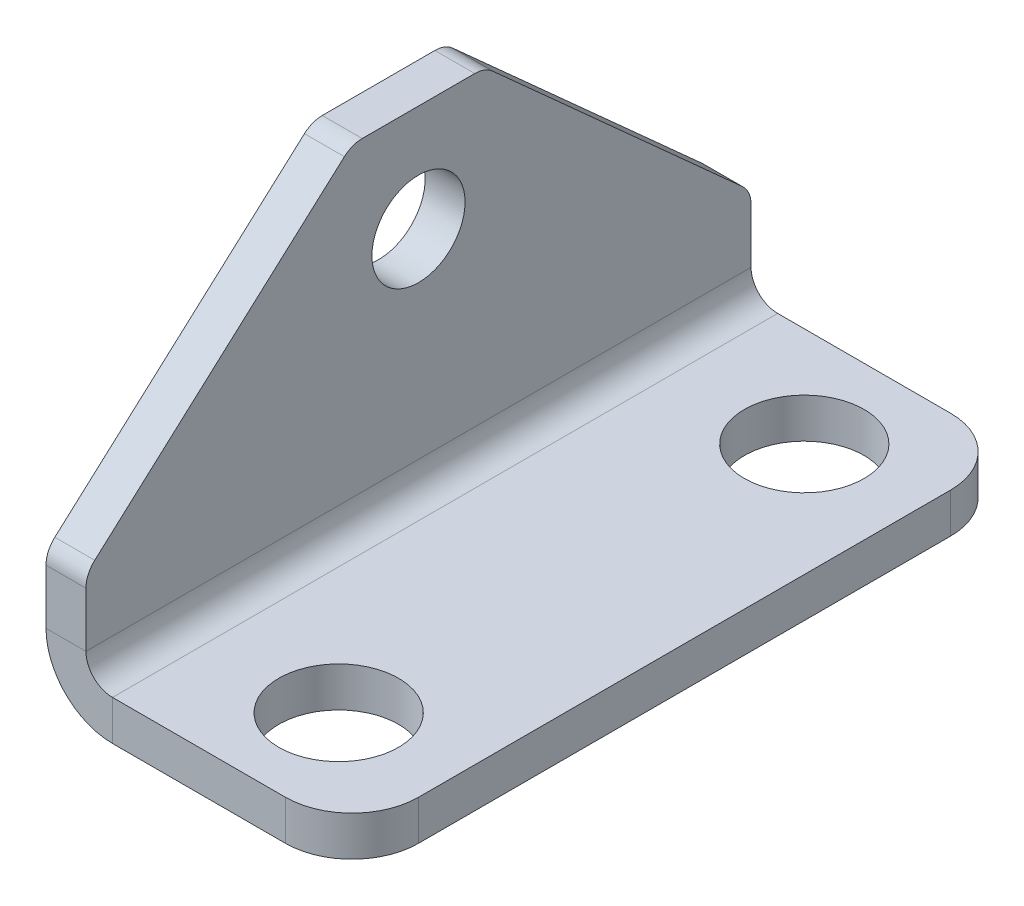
ISO-10303-21;
HEADER;
FILE_DESCRIPTION(('STEP AP214'),'2;1');
FILE_NAME('part.step','',(''),(''),'','','');
FILE_SCHEMA(('AUTOMOTIVE_DESIGN { 1 0 10303 214 1 1 1 1 }'));
ENDSEC;
DATA;
#1=APPLICATION_CONTEXT('core data for automotive mechanical design processes');
#2=APPLICATION_PROTOCOL_DEFINITION('international standard','automotive_design',2000,#1);
#3=PRODUCT_CONTEXT('',#1,'mechanical');
#4=PRODUCT('Part','Part','',(#3));
#5=PRODUCT_RELATED_PRODUCT_CATEGORY('part','',(#4));
#6=PRODUCT_DEFINITION_FORMATION('','',#4);
#7=PRODUCT_DEFINITION_CONTEXT('part definition',#1,'design');
#8=PRODUCT_DEFINITION('design','',#6,#7);
#9=PRODUCT_DEFINITION_SHAPE('','',#8);
#10=(LENGTH_UNIT() NAMED_UNIT(*) SI_UNIT(.MILLI.,.METRE.));
#11=(NAMED_UNIT(*) PLANE_ANGLE_UNIT() SI_UNIT($,.RADIAN.));
#12=(NAMED_UNIT(*) SI_UNIT($,.STERADIAN.) SOLID_ANGLE_UNIT());
#13=UNCERTAINTY_MEASURE_WITH_UNIT(LENGTH_MEASURE(1.E-05),#10,'distance_accuracy_value','');
#14=(GEOMETRIC_REPRESENTATION_CONTEXT(3) GLOBAL_UNCERTAINTY_ASSIGNED_CONTEXT((#13)) GLOBAL_UNIT_ASSIGNED_CONTEXT((#10,
#11,#12)) REPRESENTATION_CONTEXT('',''));
#15=CARTESIAN_POINT('',(0.,0.,0.));
#16=DIRECTION('',(0.,0.,1.));
#17=DIRECTION('',(1.,0.,0.));
#18=AXIS2_PLACEMENT_3D('',#15,#16,#17);
#19=CARTESIAN_POINT('',(0.,0.,50.));
#20=DIRECTION('',(1.,0.,0.));
#21=DIRECTION('',(0.,0.,-1.));
#22=AXIS2_PLACEMENT_3D('',#19,#20,#21);
#23=PLANE('',#22);
#24=CARTESIAN_POINT('',(0.,17.,25.));
#25=DIRECTION('',(1.,0.,0.));
#26=DIRECTION('',(0.,0.,-1.));
#27=AXIS2_PLACEMENT_3D('',#24,#25,#26);
#28=CIRCLE('',#27,3.49999999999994);
#29=CARTESIAN_POINT('',(0.,17.,21.5000000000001));
#30=VERTEX_POINT('',#29);
#31=EDGE_CURVE('E318',#30,#30,#28,.T.);
#32=ORIENTED_EDGE('',*,*,#31,.F.);
#33=EDGE_LOOP('',(#32));
#34=FACE_BOUND('',#33,.T.);
#35=DIRECTION('',(0.,0.66896473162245,-0.743294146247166));
#36=VECTOR('',#35,1.);
#37=CARTESIAN_POINT('',(0.,3.86740331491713,53.4806629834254));
#38=LINE('',#37,#36);
#39=CARTESIAN_POINT('',(0.,7.59586348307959,49.3379294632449));
#40=VERTEX_POINT('',#39);
#41=CARTESIAN_POINT('',(0.,24.4865882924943,30.5704574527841));
#42=VERTEX_POINT('',#41);
#43=EDGE_CURVE('E327',#40,#42,#38,.T.);
#44=ORIENTED_EDGE('',*,*,#43,.F.);
#45=CARTESIAN_POINT('',(0.,6.10927519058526,48.));
#46=DIRECTION('',(1.,0.,0.));
#47=DIRECTION('',(0.,0.,-1.));
#48=AXIS2_PLACEMENT_3D('',#45,#46,#47);
#49=CIRCLE('',#48,2.);
#50=CARTESIAN_POINT('',(0.,6.10927519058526,50.));
#51=VERTEX_POINT('',#50);
#52=EDGE_CURVE('E263',#40,#51,#49,.T.);
#53=ORIENTED_EDGE('',*,*,#52,.T.);
#54=DIRECTION('',(0.,-1.,0.));
#55=VECTOR('',#54,1.);
#56=CARTESIAN_POINT('',(0.,0.,50.));
#57=LINE('',#56,#55);
#58=CARTESIAN_POINT('',(0.,2.,50.));
#59=VERTEX_POINT('',#58);
#60=EDGE_CURVE('E213',#51,#59,#57,.T.);
#61=ORIENTED_EDGE('',*,*,#60,.T.);
#62=DIRECTION('',(0.,0.,-1.));
#63=VECTOR('',#62,1.);
#64=CARTESIAN_POINT('',(0.,2.,50.));
#65=LINE('',#64,#63);
#66=CARTESIAN_POINT('',(0.,2.,0.));
#67=VERTEX_POINT('',#66);
#68=EDGE_CURVE('E190',#59,#67,#65,.T.);
#69=ORIENTED_EDGE('',*,*,#68,.T.);
#70=DIRECTION('',(0.,-1.,0.));
#71=VECTOR('',#70,1.);
#72=CARTESIAN_POINT('',(0.,0.,0.));
#73=LINE('',#72,#71);
#74=CARTESIAN_POINT('',(0.,6.10927519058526,0.));
#75=VERTEX_POINT('',#74);
#76=EDGE_CURVE('E199',#75,#67,#73,.T.);
#77=ORIENTED_EDGE('',*,*,#76,.F.);
#78=CARTESIAN_POINT('',(0.,6.10927519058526,2.));
#79=DIRECTION('',(1.,0.,0.));
#80=DIRECTION('',(0.,0.,-1.));
#81=AXIS2_PLACEMENT_3D('',#78,#79,#80);
#82=CIRCLE('',#81,2.);
#83=CARTESIAN_POINT('',(0.,7.59586348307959,0.662070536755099));
#84=VERTEX_POINT('',#83);
#85=EDGE_CURVE('E261',#75,#84,#82,.T.);
#86=ORIENTED_EDGE('',*,*,#85,.T.);
#87=DIRECTION('',(0.,-0.66896473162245,-0.743294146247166));
#88=VECTOR('',#87,1.);
#89=CARTESIAN_POINT('',(0.,28.7292817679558,24.1436464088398));
#90=LINE('',#89,#88);
#91=CARTESIAN_POINT('',(0.,24.4865882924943,19.4295425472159));
#92=VERTEX_POINT('',#91);
#93=EDGE_CURVE('E333',#92,#84,#90,.T.);
#94=ORIENTED_EDGE('',*,*,#93,.F.);
#95=CARTESIAN_POINT('',(0.,23.,20.7674720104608));
#96=DIRECTION('',(1.,0.,0.));
#97=DIRECTION('',(0.,0.,-1.));
#98=AXIS2_PLACEMENT_3D('',#95,#96,#97);
#99=CIRCLE('',#98,2.);
#100=CARTESIAN_POINT('',(0.,25.,20.7674720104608));
#101=VERTEX_POINT('',#100);
#102=EDGE_CURVE('E257',#92,#101,#99,.T.);
#103=ORIENTED_EDGE('',*,*,#102,.T.);
#104=DIRECTION('',(0.,0.,-1.));
#105=VECTOR('',#104,1.);
#106=CARTESIAN_POINT('',(0.,25.,50.));
#107=LINE('',#106,#105);
#108=CARTESIAN_POINT('',(0.,25.,29.2325279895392));
#109=VERTEX_POINT('',#108);
#110=EDGE_CURVE('E229',#109,#101,#107,.T.);
#111=ORIENTED_EDGE('',*,*,#110,.F.);
#112=CARTESIAN_POINT('',(0.,23.,29.2325279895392));
#113=DIRECTION('',(1.,0.,0.));
#114=DIRECTION('',(0.,0.,-1.));
#115=AXIS2_PLACEMENT_3D('',#112,#113,#114);
#116=CIRCLE('',#115,2.);
#117=EDGE_CURVE('E259',#109,#42,#116,.T.);
#118=ORIENTED_EDGE('',*,*,#117,.T.);
#119=EDGE_LOOP('',(#44,#53,#61,#69,#77,#86,#94,#103,#111,#118));
#120=FACE_BOUND('',#119,.T.);
#121=ADVANCED_FACE('F47',(#34,#120),#23,.T.);
#122=CARTESIAN_POINT('',(-3.,25.,50.));
#123=DIRECTION('',(0.,1.,0.));
#124=DIRECTION('',(0.,0.,1.));
#125=AXIS2_PLACEMENT_3D('',#122,#123,#124);
#126=PLANE('',#125);
#127=DIRECTION('',(0.,0.,-1.));
#128=VECTOR('',#127,1.);
#129=CARTESIAN_POINT('',(-3.,25.,50.));
#130=LINE('',#129,#128);
#131=CARTESIAN_POINT('',(-3.,25.,29.2325279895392));
#132=VERTEX_POINT('',#131);
#133=CARTESIAN_POINT('',(-3.,25.,20.7674720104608));
#134=VERTEX_POINT('',#133);
#135=EDGE_CURVE('E226',#132,#134,#130,.T.);
#136=ORIENTED_EDGE('',*,*,#135,.F.);
#137=DIRECTION('',(1.,0.,0.));
#138=VECTOR('',#137,1.);
#139=CARTESIAN_POINT('',(-3.,25.,29.2325279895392));
#140=LINE('',#139,#138);
#141=EDGE_CURVE('E275',#132,#109,#140,.T.);
#142=ORIENTED_EDGE('',*,*,#141,.T.);
#143=ORIENTED_EDGE('',*,*,#110,.T.);
#144=DIRECTION('',(1.,0.,0.));
#145=VECTOR('',#144,1.);
#146=CARTESIAN_POINT('',(-3.,25.,20.7674720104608));
#147=LINE('',#146,#145);
#148=EDGE_CURVE('E272',#101,#134,#147,.F.);
#149=ORIENTED_EDGE('',*,*,#148,.T.);
#150=EDGE_LOOP('',(#136,#142,#143,#149));
#151=FACE_BOUND('',#150,.T.);
#152=ADVANCED_FACE('F374',(#151),#126,.T.);
#153=CARTESIAN_POINT('',(-3.,0.,50.));
#154=DIRECTION('',(1.,0.,0.));
#155=DIRECTION('',(0.,0.,-1.));
#156=AXIS2_PLACEMENT_3D('',#153,#154,#155);
#157=PLANE('',#156);
#158=CARTESIAN_POINT('',(-3.,17.,25.));
#159=DIRECTION('',(-1.,0.,0.));
#160=DIRECTION('',(0.,0.,1.));
#161=AXIS2_PLACEMENT_3D('',#158,#159,#160);
#162=CIRCLE('',#161,3.49999999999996);
#163=CARTESIAN_POINT('',(-3.,17.,28.5));
#164=VERTEX_POINT('',#163);
#165=EDGE_CURVE('E321',#164,#164,#162,.T.);
#166=ORIENTED_EDGE('',*,*,#165,.F.);
#167=EDGE_LOOP('',(#166));
#168=FACE_BOUND('',#167,.T.);
#169=DIRECTION('',(0.,1.,0.));
#170=VECTOR('',#169,1.);
#171=CARTESIAN_POINT('',(-3.,0.,50.));
#172=LINE('',#171,#170);
#173=CARTESIAN_POINT('',(-3.,6.10927519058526,50.));
#174=VERTEX_POINT('',#173);
#175=CARTESIAN_POINT('',(-3.,2.,50.));
#176=VERTEX_POINT('',#175);
#177=EDGE_CURVE('E215',#174,#176,#172,.F.);
#178=ORIENTED_EDGE('',*,*,#177,.F.);
#179=CARTESIAN_POINT('',(-3.,6.10927519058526,48.));
#180=DIRECTION('',(1.,0.,0.));
#181=DIRECTION('',(0.,0.,-1.));
#182=AXIS2_PLACEMENT_3D('',#179,#180,#181);
#183=CIRCLE('',#182,2.);
#184=CARTESIAN_POINT('',(-3.,7.59586348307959,49.3379294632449));
#185=VERTEX_POINT('',#184);
#186=EDGE_CURVE('E250',#174,#185,#183,.F.);
#187=ORIENTED_EDGE('',*,*,#186,.T.);
#188=DIRECTION('',(0.,0.66896473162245,-0.743294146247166));
#189=VECTOR('',#188,1.);
#190=CARTESIAN_POINT('',(-3.,3.86740331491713,53.4806629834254));
#191=LINE('',#190,#189);
#192=CARTESIAN_POINT('',(-3.,24.4865882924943,30.5704574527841));
#193=VERTEX_POINT('',#192);
#194=EDGE_CURVE('E324',#185,#193,#191,.T.);
#195=ORIENTED_EDGE('',*,*,#194,.T.);
#196=CARTESIAN_POINT('',(-3.,23.,29.2325279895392));
#197=DIRECTION('',(1.,0.,0.));
#198=DIRECTION('',(0.,0.,-1.));
#199=AXIS2_PLACEMENT_3D('',#196,#197,#198);
#200=CIRCLE('',#199,2.);
#201=EDGE_CURVE('E246',#193,#132,#200,.F.);
#202=ORIENTED_EDGE('',*,*,#201,.T.);
#203=ORIENTED_EDGE('',*,*,#135,.T.);
#204=CARTESIAN_POINT('',(-3.,23.,20.7674720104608));
#205=DIRECTION('',(1.,0.,0.));
#206=DIRECTION('',(0.,0.,-1.));
#207=AXIS2_PLACEMENT_3D('',#204,#205,#206);
#208=CIRCLE('',#207,2.);
#209=CARTESIAN_POINT('',(-3.,24.4865882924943,19.4295425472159));
#210=VERTEX_POINT('',#209);
#211=EDGE_CURVE('E244',#134,#210,#208,.F.);
#212=ORIENTED_EDGE('',*,*,#211,.T.);
#213=DIRECTION('',(0.,-0.66896473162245,-0.743294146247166));
#214=VECTOR('',#213,1.);
#215=CARTESIAN_POINT('',(-3.,28.7292817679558,24.1436464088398));
#216=LINE('',#215,#214);
#217=CARTESIAN_POINT('',(-3.,7.59586348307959,0.662070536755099));
#218=VERTEX_POINT('',#217);
#219=EDGE_CURVE('E330',#210,#218,#216,.T.);
#220=ORIENTED_EDGE('',*,*,#219,.T.);
#221=CARTESIAN_POINT('',(-3.,6.10927519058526,2.));
#222=DIRECTION('',(1.,0.,0.));
#223=DIRECTION('',(0.,0.,-1.));
#224=AXIS2_PLACEMENT_3D('',#221,#222,#223);
#225=CIRCLE('',#224,2.);
#226=CARTESIAN_POINT('',(-3.,6.10927519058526,0.));
#227=VERTEX_POINT('',#226);
#228=EDGE_CURVE('E248',#218,#227,#225,.F.);
#229=ORIENTED_EDGE('',*,*,#228,.T.);
#230=DIRECTION('',(0.,1.,0.));
#231=VECTOR('',#230,1.);
#232=CARTESIAN_POINT('',(-3.,0.,0.));
#233=LINE('',#232,#231);
#234=CARTESIAN_POINT('',(-3.,2.,0.));
#235=VERTEX_POINT('',#234);
#236=EDGE_CURVE('E201',#227,#235,#233,.F.);
#237=ORIENTED_EDGE('',*,*,#236,.T.);
#238=DIRECTION('',(0.,0.,-1.));
#239=VECTOR('',#238,1.);
#240=CARTESIAN_POINT('',(-3.,2.,50.));
#241=LINE('',#240,#239);
#242=EDGE_CURVE('E223',#176,#235,#241,.T.);
#243=ORIENTED_EDGE('',*,*,#242,.F.);
#244=EDGE_LOOP('',(#178,#187,#195,#202,#203,#212,#220,#229,#237,#243));
#245=FACE_BOUND('',#244,.T.);
#246=ADVANCED_FACE('F350',(#168,#245),#157,.F.);
#247=CARTESIAN_POINT('',(2.,-3.,0.));
#248=DIRECTION('',(0.,0.,-1.));
#249=DIRECTION('',(-1.,0.,0.));
#250=AXIS2_PLACEMENT_3D('',#247,#248,#249);
#251=PLANE('',#250);
#252=ORIENTED_EDGE('',*,*,#236,.F.);
#253=DIRECTION('',(1.,0.,0.));
#254=VECTOR('',#253,1.);
#255=CARTESIAN_POINT('',(2.,6.10927519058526,0.));
#256=LINE('',#255,#254);
#257=EDGE_CURVE('E270',#227,#75,#256,.T.);
#258=ORIENTED_EDGE('',*,*,#257,.T.);
#259=ORIENTED_EDGE('',*,*,#76,.T.);
#260=DIRECTION('',(-1.,0.,0.));
#261=VECTOR('',#260,1.);
#262=CARTESIAN_POINT('',(0.,2.,0.));
#263=LINE('',#262,#261);
#264=EDGE_CURVE('E175',#67,#235,#263,.T.);
#265=ORIENTED_EDGE('',*,*,#264,.T.);
#266=EDGE_LOOP('',(#252,#258,#259,#265));
#267=FACE_BOUND('',#266,.T.);
#268=ADVANCED_FACE('F352',(#267),#251,.T.);
#269=CARTESIAN_POINT('',(2.,2.,50.));
#270=DIRECTION('',(0.,0.,-1.));
#271=DIRECTION('',(-1.,0.,0.));
#272=AXIS2_PLACEMENT_3D('',#269,#270,#271);
#273=PLANE('',#272);
#274=ORIENTED_EDGE('',*,*,#60,.F.);
#275=DIRECTION('',(1.,0.,0.));
#276=VECTOR('',#275,1.);
#277=CARTESIAN_POINT('',(-3.,6.10927519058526,50.));
#278=LINE('',#277,#276);
#279=EDGE_CURVE('E241',#51,#174,#278,.F.);
#280=ORIENTED_EDGE('',*,*,#279,.T.);
#281=ORIENTED_EDGE('',*,*,#177,.T.);
#282=DIRECTION('',(1.,0.,0.));
#283=VECTOR('',#282,1.);
#284=CARTESIAN_POINT('',(-3.,2.,50.));
#285=LINE('',#284,#283);
#286=EDGE_CURVE('E236',#176,#59,#285,.T.);
#287=ORIENTED_EDGE('',*,*,#286,.T.);
#288=EDGE_LOOP('',(#274,#280,#281,#287));
#289=FACE_BOUND('',#288,.T.);
#290=ADVANCED_FACE('F357',(#289),#273,.F.);
#291=CARTESIAN_POINT('',(2.,0.,50.));
#292=DIRECTION('',(0.,0.,1.));
#293=DIRECTION('',(1.,0.,0.));
#294=AXIS2_PLACEMENT_3D('',#291,#292,#293);
#295=PLANE('',#294);
#296=DIRECTION('',(0.,-1.,0.));
#297=VECTOR('',#296,1.);
#298=CARTESIAN_POINT('',(2.,0.,50.));
#299=LINE('',#298,#297);
#300=CARTESIAN_POINT('',(2.,0.,50.));
#301=VERTEX_POINT('',#300);
#302=CARTESIAN_POINT('',(2.,-3.,50.));
#303=VERTEX_POINT('',#302);
#304=EDGE_CURVE('E239',#301,#303,#299,.T.);
#305=ORIENTED_EDGE('',*,*,#304,.F.);
#306=CARTESIAN_POINT('',(2.,2.,50.));
#307=DIRECTION('',(0.,0.,-1.));
#308=DIRECTION('',(-1.,0.,0.));
#309=AXIS2_PLACEMENT_3D('',#306,#307,#308);
#310=CIRCLE('',#309,2.);
#311=EDGE_CURVE('E187',#59,#301,#310,.F.);
#312=ORIENTED_EDGE('',*,*,#311,.F.);
#313=ORIENTED_EDGE('',*,*,#286,.F.);
#314=CARTESIAN_POINT('',(2.,2.,50.));
#315=DIRECTION('',(0.,0.,1.));
#316=DIRECTION('',(1.,0.,0.));
#317=AXIS2_PLACEMENT_3D('',#314,#315,#316);
#318=CIRCLE('',#317,5.);
#319=EDGE_CURVE('E217',#176,#303,#318,.T.);
#320=ORIENTED_EDGE('',*,*,#319,.T.);
#321=EDGE_LOOP('',(#305,#312,#313,#320));
#322=FACE_BOUND('',#321,.T.);
#323=ADVANCED_FACE('F49',(#322),#295,.T.);
#324=CARTESIAN_POINT('',(-3.,2.,50.));
#325=DIRECTION('',(0.,0.,1.));
#326=DIRECTION('',(1.,0.,0.));
#327=AXIS2_PLACEMENT_3D('',#324,#325,#326);
#328=PLANE('',#327);
#329=DIRECTION('',(1.,0.,0.));
#330=VECTOR('',#329,1.);
#331=CARTESIAN_POINT('',(0.,-3.,50.));
#332=LINE('',#331,#330);
#333=CARTESIAN_POINT('',(15.,-3.,50.));
#334=VERTEX_POINT('',#333);
#335=EDGE_CURVE('E208',#303,#334,#332,.T.);
#336=ORIENTED_EDGE('',*,*,#335,.T.);
#337=DIRECTION('',(0.,-1.,0.));
#338=VECTOR('',#337,1.);
#339=CARTESIAN_POINT('',(15.,2.,50.));
#340=LINE('',#339,#338);
#341=CARTESIAN_POINT('',(15.,0.,50.));
#342=VERTEX_POINT('',#341);
#343=EDGE_CURVE('E13',#334,#342,#340,.F.);
#344=ORIENTED_EDGE('',*,*,#343,.T.);
#345=DIRECTION('',(1.,0.,0.));
#346=VECTOR('',#345,1.);
#347=CARTESIAN_POINT('',(0.,0.,50.));
#348=LINE('',#347,#346);
#349=EDGE_CURVE('E210',#301,#342,#348,.T.);
#350=ORIENTED_EDGE('',*,*,#349,.F.);
#351=ORIENTED_EDGE('',*,*,#304,.T.);
#352=EDGE_LOOP('',(#336,#344,#350,#351));
#353=FACE_BOUND('',#352,.T.);
#354=ADVANCED_FACE('F297',(#353),#328,.T.);
#355=CARTESIAN_POINT('',(0.,2.,0.));
#356=DIRECTION('',(0.,0.,-1.));
#357=DIRECTION('',(-1.,0.,0.));
#358=AXIS2_PLACEMENT_3D('',#355,#356,#357);
#359=PLANE('',#358);
#360=ORIENTED_EDGE('',*,*,#264,.F.);
#361=CARTESIAN_POINT('',(2.,2.,0.));
#362=DIRECTION('',(0.,0.,-1.));
#363=DIRECTION('',(-1.,0.,0.));
#364=AXIS2_PLACEMENT_3D('',#361,#362,#363);
#365=CIRCLE('',#364,2.);
#366=CARTESIAN_POINT('',(2.,0.,0.));
#367=VERTEX_POINT('',#366);
#368=EDGE_CURVE('E185',#67,#367,#365,.F.);
#369=ORIENTED_EDGE('',*,*,#368,.T.);
#370=DIRECTION('',(0.,1.,0.));
#371=VECTOR('',#370,1.);
#372=CARTESIAN_POINT('',(2.,-3.,0.));
#373=LINE('',#372,#371);
#374=CARTESIAN_POINT('',(2.,-3.,0.));
#375=VERTEX_POINT('',#374);
#376=EDGE_CURVE('E162',#375,#367,#373,.T.);
#377=ORIENTED_EDGE('',*,*,#376,.F.);
#378=CARTESIAN_POINT('',(2.,2.,0.));
#379=DIRECTION('',(0.,0.,1.));
#380=DIRECTION('',(1.,0.,0.));
#381=AXIS2_PLACEMENT_3D('',#378,#379,#380);
#382=CIRCLE('',#381,5.);
#383=EDGE_CURVE('E206',#235,#375,#382,.T.);
#384=ORIENTED_EDGE('',*,*,#383,.F.);
#385=EDGE_LOOP('',(#360,#369,#377,#384));
#386=FACE_BOUND('',#385,.T.);
#387=ADVANCED_FACE('F196',(#386),#359,.T.);
#388=CARTESIAN_POINT('',(0.,-3.,50.));
#389=DIRECTION('',(0.,1.,0.));
#390=DIRECTION('',(0.,0.,1.));
#391=AXIS2_PLACEMENT_3D('',#388,#389,#390);
#392=PLANE('',#391);
#393=CARTESIAN_POINT('',(11.5,-3.,7.5));
#394=DIRECTION('',(0.,1.,0.));
#395=DIRECTION('',(0.,0.,1.));
#396=AXIS2_PLACEMENT_3D('',#393,#394,#395);
#397=CIRCLE('',#396,4.49999999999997);
#398=CARTESIAN_POINT('',(11.5,-3.,12.));
#399=VERTEX_POINT('',#398);
#400=EDGE_CURVE('E312',#399,#399,#397,.T.);
#401=ORIENTED_EDGE('',*,*,#400,.T.);
#402=EDGE_LOOP('',(#401));
#403=FACE_BOUND('',#402,.T.);
#404=CARTESIAN_POINT('',(11.5,-3.,42.5));
#405=DIRECTION('',(0.,1.,0.));
#406=DIRECTION('',(0.,0.,1.));
#407=AXIS2_PLACEMENT_3D('',#404,#405,#406);
#408=CIRCLE('',#407,4.49999999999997);
#409=CARTESIAN_POINT('',(11.5,-3.,47.));
#410=VERTEX_POINT('',#409);
#411=EDGE_CURVE('E305',#410,#410,#408,.T.);
#412=ORIENTED_EDGE('',*,*,#411,.T.);
#413=EDGE_LOOP('',(#412));
#414=FACE_BOUND('',#413,.T.);
#415=DIRECTION('',(1.,0.,0.));
#416=VECTOR('',#415,1.);
#417=CARTESIAN_POINT('',(0.,-3.,0.));
#418=LINE('',#417,#416);
#419=CARTESIAN_POINT('',(15.,-3.,0.));
#420=VERTEX_POINT('',#419);
#421=EDGE_CURVE('E170',#375,#420,#418,.T.);
#422=ORIENTED_EDGE('',*,*,#421,.T.);
#423=CARTESIAN_POINT('',(15.,-3.,5.));
#424=DIRECTION('',(0.,1.,0.));
#425=DIRECTION('',(0.,0.,1.));
#426=AXIS2_PLACEMENT_3D('',#423,#424,#425);
#427=CIRCLE('',#426,5.);
#428=CARTESIAN_POINT('',(20.,-3.,5.));
#429=VERTEX_POINT('',#428);
#430=EDGE_CURVE('E281',#420,#429,#427,.F.);
#431=ORIENTED_EDGE('',*,*,#430,.T.);
#432=DIRECTION('',(0.,0.,-1.));
#433=VECTOR('',#432,1.);
#434=CARTESIAN_POINT('',(20.,-3.,50.));
#435=LINE('',#434,#433);
#436=CARTESIAN_POINT('',(20.,-3.,45.));
#437=VERTEX_POINT('',#436);
#438=EDGE_CURVE('E176',#437,#429,#435,.T.);
#439=ORIENTED_EDGE('',*,*,#438,.F.);
#440=CARTESIAN_POINT('',(15.,-3.,45.));
#441=DIRECTION('',(0.,1.,0.));
#442=DIRECTION('',(0.,0.,1.));
#443=AXIS2_PLACEMENT_3D('',#440,#441,#442);
#444=CIRCLE('',#443,5.);
#445=EDGE_CURVE('E279',#437,#334,#444,.F.);
#446=ORIENTED_EDGE('',*,*,#445,.T.);
#447=ORIENTED_EDGE('',*,*,#335,.F.);
#448=DIRECTION('',(0.,0.,-1.));
#449=VECTOR('',#448,1.);
#450=CARTESIAN_POINT('',(2.,-3.,50.));
#451=LINE('',#450,#449);
#452=EDGE_CURVE('E220',#303,#375,#451,.T.);
#453=ORIENTED_EDGE('',*,*,#452,.T.);
#454=EDGE_LOOP('',(#422,#431,#439,#446,#447,#453));
#455=FACE_BOUND('',#454,.T.);
#456=ADVANCED_FACE('F296',(#403,#414,#455),#392,.F.);
#457=CARTESIAN_POINT('',(20.,0.,50.));
#458=DIRECTION('',(1.,0.,0.));
#459=DIRECTION('',(0.,0.,-1.));
#460=AXIS2_PLACEMENT_3D('',#457,#458,#459);
#461=PLANE('',#460);
#462=ORIENTED_EDGE('',*,*,#438,.T.);
#463=DIRECTION('',(0.,-1.,0.));
#464=VECTOR('',#463,1.);
#465=CARTESIAN_POINT('',(20.,0.,5.));
#466=LINE('',#465,#464);
#467=CARTESIAN_POINT('',(20.,0.,5.));
#468=VERTEX_POINT('',#467);
#469=EDGE_CURVE('E68',#429,#468,#466,.F.);
#470=ORIENTED_EDGE('',*,*,#469,.T.);
#471=DIRECTION('',(0.,0.,-1.));
#472=VECTOR('',#471,1.);
#473=CARTESIAN_POINT('',(20.,0.,50.));
#474=LINE('',#473,#472);
#475=CARTESIAN_POINT('',(20.,0.,45.));
#476=VERTEX_POINT('',#475);
#477=EDGE_CURVE('E189',#476,#468,#474,.T.);
#478=ORIENTED_EDGE('',*,*,#477,.F.);
#479=DIRECTION('',(0.,-1.,0.));
#480=VECTOR('',#479,1.);
#481=CARTESIAN_POINT('',(20.,0.,45.));
#482=LINE('',#481,#480);
#483=EDGE_CURVE('E283',#476,#437,#482,.T.);
#484=ORIENTED_EDGE('',*,*,#483,.T.);
#485=EDGE_LOOP('',(#462,#470,#478,#484));
#486=FACE_BOUND('',#485,.T.);
#487=ADVANCED_FACE('F291',(#486),#461,.T.);
#488=CARTESIAN_POINT('',(0.,0.,50.));
#489=DIRECTION('',(0.,1.,0.));
#490=DIRECTION('',(0.,0.,1.));
#491=AXIS2_PLACEMENT_3D('',#488,#489,#490);
#492=PLANE('',#491);
#493=CARTESIAN_POINT('',(11.5,0.,7.5));
#494=DIRECTION('',(0.,1.,0.));
#495=DIRECTION('',(0.,0.,1.));
#496=AXIS2_PLACEMENT_3D('',#493,#494,#495);
#497=CIRCLE('',#496,4.49999999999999);
#498=CARTESIAN_POINT('',(11.5,0.,12.));
#499=VERTEX_POINT('',#498);
#500=EDGE_CURVE('E315',#499,#499,#497,.T.);
#501=ORIENTED_EDGE('',*,*,#500,.F.);
#502=EDGE_LOOP('',(#501));
#503=FACE_BOUND('',#502,.T.);
#504=CARTESIAN_POINT('',(11.5,0.,42.5));
#505=DIRECTION('',(0.,1.,0.));
#506=DIRECTION('',(0.,0.,1.));
#507=AXIS2_PLACEMENT_3D('',#504,#505,#506);
#508=CIRCLE('',#507,4.49999999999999);
#509=CARTESIAN_POINT('',(11.5,0.,47.));
#510=VERTEX_POINT('',#509);
#511=EDGE_CURVE('E307',#510,#510,#508,.T.);
#512=ORIENTED_EDGE('',*,*,#511,.F.);
#513=EDGE_LOOP('',(#512));
#514=FACE_BOUND('',#513,.T.);
#515=ORIENTED_EDGE('',*,*,#477,.T.);
#516=CARTESIAN_POINT('',(15.,0.,5.));
#517=DIRECTION('',(0.,1.,0.));
#518=DIRECTION('',(0.,0.,1.));
#519=AXIS2_PLACEMENT_3D('',#516,#517,#518);
#520=CIRCLE('',#519,5.);
#521=CARTESIAN_POINT('',(15.,0.,0.));
#522=VERTEX_POINT('',#521);
#523=EDGE_CURVE('E55',#468,#522,#520,.T.);
#524=ORIENTED_EDGE('',*,*,#523,.T.);
#525=DIRECTION('',(1.,0.,0.));
#526=VECTOR('',#525,1.);
#527=CARTESIAN_POINT('',(0.,0.,0.));
#528=LINE('',#527,#526);
#529=EDGE_CURVE('E167',#367,#522,#528,.T.);
#530=ORIENTED_EDGE('',*,*,#529,.F.);
#531=DIRECTION('',(0.,0.,-1.));
#532=VECTOR('',#531,1.);
#533=CARTESIAN_POINT('',(2.,0.,50.));
#534=LINE('',#533,#532);
#535=EDGE_CURVE('E182',#301,#367,#534,.T.);
#536=ORIENTED_EDGE('',*,*,#535,.F.);
#537=ORIENTED_EDGE('',*,*,#349,.T.);
#538=CARTESIAN_POINT('',(15.,0.,45.));
#539=DIRECTION('',(0.,1.,0.));
#540=DIRECTION('',(0.,0.,1.));
#541=AXIS2_PLACEMENT_3D('',#538,#539,#540);
#542=CIRCLE('',#541,5.);
#543=EDGE_CURVE('E287',#342,#476,#542,.T.);
#544=ORIENTED_EDGE('',*,*,#543,.T.);
#545=EDGE_LOOP('',(#515,#524,#530,#536,#537,#544));
#546=FACE_BOUND('',#545,.T.);
#547=ADVANCED_FACE('F192',(#503,#514,#546),#492,.T.);
#548=CARTESIAN_POINT('',(2.,2.,50.));
#549=DIRECTION('',(0.,0.,-1.));
#550=DIRECTION('',(-1.,0.,0.));
#551=AXIS2_PLACEMENT_3D('',#548,#549,#550);
#552=CYLINDRICAL_SURFACE('',#551,2.);
#553=ORIENTED_EDGE('',*,*,#368,.F.);
#554=ORIENTED_EDGE('',*,*,#68,.F.);
#555=ORIENTED_EDGE('',*,*,#311,.T.);
#556=ORIENTED_EDGE('',*,*,#535,.T.);
#557=EDGE_LOOP('',(#553,#554,#555,#556));
#558=FACE_BOUND('',#557,.T.);
#559=ADVANCED_FACE('F183',(#558),#552,.F.);
#560=CARTESIAN_POINT('',(2.,2.,50.));
#561=DIRECTION('',(0.,0.,-1.));
#562=DIRECTION('',(-1.,0.,0.));
#563=AXIS2_PLACEMENT_3D('',#560,#561,#562);
#564=CYLINDRICAL_SURFACE('',#563,5.);
#565=ORIENTED_EDGE('',*,*,#383,.T.);
#566=ORIENTED_EDGE('',*,*,#452,.F.);
#567=ORIENTED_EDGE('',*,*,#319,.F.);
#568=ORIENTED_EDGE('',*,*,#242,.T.);
#569=EDGE_LOOP('',(#565,#566,#567,#568));
#570=FACE_BOUND('',#569,.T.);
#571=ADVANCED_FACE('F304',(#570),#564,.T.);
#572=CARTESIAN_POINT('',(2.,2.,0.));
#573=DIRECTION('',(0.,0.,-1.));
#574=DIRECTION('',(-1.,0.,0.));
#575=AXIS2_PLACEMENT_3D('',#572,#573,#574);
#576=PLANE('',#575);
#577=ORIENTED_EDGE('',*,*,#529,.T.);
#578=DIRECTION('',(0.,-1.,0.));
#579=VECTOR('',#578,1.);
#580=CARTESIAN_POINT('',(15.,2.,0.));
#581=LINE('',#580,#579);
#582=EDGE_CURVE('E277',#522,#420,#581,.T.);
#583=ORIENTED_EDGE('',*,*,#582,.T.);
#584=ORIENTED_EDGE('',*,*,#421,.F.);
#585=ORIENTED_EDGE('',*,*,#376,.T.);
#586=EDGE_LOOP('',(#577,#583,#584,#585));
#587=FACE_BOUND('',#586,.T.);
#588=ADVANCED_FACE('F164',(#587),#576,.T.);
#589=CARTESIAN_POINT('',(11.5,0.,42.5));
#590=DIRECTION('',(0.,1.,0.));
#591=DIRECTION('',(0.,0.,1.));
#592=AXIS2_PLACEMENT_3D('',#589,#590,#591);
#593=CYLINDRICAL_SURFACE('',#592,4.49999999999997);
#594=ORIENTED_EDGE('',*,*,#511,.T.);
#595=EDGE_LOOP('',(#594));
#596=FACE_BOUND('',#595,.T.);
#597=ORIENTED_EDGE('',*,*,#411,.F.);
#598=EDGE_LOOP('',(#597));
#599=FACE_BOUND('',#598,.T.);
#600=ADVANCED_FACE('F441',(#596,#599),#593,.F.);
#601=CARTESIAN_POINT('',(11.5,0.,7.5));
#602=DIRECTION('',(0.,1.,0.));
#603=DIRECTION('',(0.,0.,1.));
#604=AXIS2_PLACEMENT_3D('',#601,#602,#603);
#605=CYLINDRICAL_SURFACE('',#604,4.49999999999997);
#606=ORIENTED_EDGE('',*,*,#500,.T.);
#607=EDGE_LOOP('',(#606));
#608=FACE_BOUND('',#607,.T.);
#609=ORIENTED_EDGE('',*,*,#400,.F.);
#610=EDGE_LOOP('',(#609));
#611=FACE_BOUND('',#610,.T.);
#612=ADVANCED_FACE('F433',(#608,#611),#605,.F.);
#613=CARTESIAN_POINT('',(-3.,17.,25.));
#614=DIRECTION('',(-1.,0.,0.));
#615=DIRECTION('',(0.,0.,1.));
#616=AXIS2_PLACEMENT_3D('',#613,#614,#615);
#617=CYLINDRICAL_SURFACE('',#616,3.49999999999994);
#618=ORIENTED_EDGE('',*,*,#31,.T.);
#619=EDGE_LOOP('',(#618));
#620=FACE_BOUND('',#619,.T.);
#621=ORIENTED_EDGE('',*,*,#165,.T.);
#622=EDGE_LOOP('',(#621));
#623=FACE_BOUND('',#622,.T.);
#624=ADVANCED_FACE('F431',(#620,#623),#617,.F.);
#625=CARTESIAN_POINT('',(0.,3.86740331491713,53.4806629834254));
#626=DIRECTION('',(0.,-0.743294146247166,-0.66896473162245));
#627=DIRECTION('',(0.,0.66896473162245,-0.743294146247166));
#628=AXIS2_PLACEMENT_3D('',#625,#626,#627);
#629=PLANE('',#628);
#630=ORIENTED_EDGE('',*,*,#194,.F.);
#631=DIRECTION('',(-1.,0.,0.));
#632=VECTOR('',#631,1.);
#633=CARTESIAN_POINT('',(0.,7.59586348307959,49.3379294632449));
#634=LINE('',#633,#632);
#635=EDGE_CURVE('E255',#185,#40,#634,.F.);
#636=ORIENTED_EDGE('',*,*,#635,.T.);
#637=ORIENTED_EDGE('',*,*,#43,.T.);
#638=DIRECTION('',(-1.,0.,0.));
#639=VECTOR('',#638,1.);
#640=CARTESIAN_POINT('',(0.,24.4865882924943,30.5704574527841));
#641=LINE('',#640,#639);
#642=EDGE_CURVE('E252',#42,#193,#641,.T.);
#643=ORIENTED_EDGE('',*,*,#642,.T.);
#644=EDGE_LOOP('',(#630,#636,#637,#643));
#645=FACE_BOUND('',#644,.T.);
#646=ADVANCED_FACE('F365',(#645),#629,.F.);
#647=CARTESIAN_POINT('',(0.,28.7292817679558,24.1436464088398));
#648=DIRECTION('',(0.,-0.743294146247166,0.66896473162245));
#649=DIRECTION('',(0.,-0.66896473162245,-0.743294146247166));
#650=AXIS2_PLACEMENT_3D('',#647,#648,#649);
#651=PLANE('',#650);
#652=ORIENTED_EDGE('',*,*,#93,.T.);
#653=DIRECTION('',(-1.,0.,0.));
#654=VECTOR('',#653,1.);
#655=CARTESIAN_POINT('',(0.,7.59586348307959,0.662070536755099));
#656=LINE('',#655,#654);
#657=EDGE_CURVE('E267',#84,#218,#656,.T.);
#658=ORIENTED_EDGE('',*,*,#657,.T.);
#659=ORIENTED_EDGE('',*,*,#219,.F.);
#660=DIRECTION('',(-1.,0.,0.));
#661=VECTOR('',#660,1.);
#662=CARTESIAN_POINT('',(0.,24.4865882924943,19.4295425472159));
#663=LINE('',#662,#661);
#664=EDGE_CURVE('E265',#210,#92,#663,.F.);
#665=ORIENTED_EDGE('',*,*,#664,.T.);
#666=EDGE_LOOP('',(#652,#658,#659,#665));
#667=FACE_BOUND('',#666,.T.);
#668=ADVANCED_FACE('F338',(#667),#651,.F.);
#669=CARTESIAN_POINT('',(2.,6.10927519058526,48.));
#670=DIRECTION('',(-1.,0.,0.));
#671=DIRECTION('',(0.,0.,1.));
#672=AXIS2_PLACEMENT_3D('',#669,#670,#671);
#673=CYLINDRICAL_SURFACE('',#672,2.);
#674=ORIENTED_EDGE('',*,*,#52,.F.);
#675=ORIENTED_EDGE('',*,*,#635,.F.);
#676=ORIENTED_EDGE('',*,*,#186,.F.);
#677=ORIENTED_EDGE('',*,*,#279,.F.);
#678=EDGE_LOOP('',(#674,#675,#676,#677));
#679=FACE_BOUND('',#678,.T.);
#680=ADVANCED_FACE('F361',(#679),#673,.T.);
#681=CARTESIAN_POINT('',(0.,6.10927519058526,2.));
#682=DIRECTION('',(1.,0.,0.));
#683=DIRECTION('',(0.,0.,-1.));
#684=AXIS2_PLACEMENT_3D('',#681,#682,#683);
#685=CYLINDRICAL_SURFACE('',#684,2.);
#686=ORIENTED_EDGE('',*,*,#85,.F.);
#687=ORIENTED_EDGE('',*,*,#257,.F.);
#688=ORIENTED_EDGE('',*,*,#228,.F.);
#689=ORIENTED_EDGE('',*,*,#657,.F.);
#690=EDGE_LOOP('',(#686,#687,#688,#689));
#691=FACE_BOUND('',#690,.T.);
#692=ADVANCED_FACE('F345',(#691),#685,.T.);
#693=CARTESIAN_POINT('',(0.,23.,29.2325279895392));
#694=DIRECTION('',(1.,0.,0.));
#695=DIRECTION('',(0.,0.,-1.));
#696=AXIS2_PLACEMENT_3D('',#693,#694,#695);
#697=CYLINDRICAL_SURFACE('',#696,2.);
#698=ORIENTED_EDGE('',*,*,#117,.F.);
#699=ORIENTED_EDGE('',*,*,#141,.F.);
#700=ORIENTED_EDGE('',*,*,#201,.F.);
#701=ORIENTED_EDGE('',*,*,#642,.F.);
#702=EDGE_LOOP('',(#698,#699,#700,#701));
#703=FACE_BOUND('',#702,.T.);
#704=ADVANCED_FACE('F371',(#703),#697,.T.);
#705=CARTESIAN_POINT('',(-3.,23.,20.7674720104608));
#706=DIRECTION('',(1.,0.,0.));
#707=DIRECTION('',(0.,0.,-1.));
#708=AXIS2_PLACEMENT_3D('',#705,#706,#707);
#709=CYLINDRICAL_SURFACE('',#708,2.);
#710=ORIENTED_EDGE('',*,*,#102,.F.);
#711=ORIENTED_EDGE('',*,*,#664,.F.);
#712=ORIENTED_EDGE('',*,*,#211,.F.);
#713=ORIENTED_EDGE('',*,*,#148,.F.);
#714=EDGE_LOOP('',(#710,#711,#712,#713));
#715=FACE_BOUND('',#714,.T.);
#716=ADVANCED_FACE('F377',(#715),#709,.T.);
#717=CARTESIAN_POINT('',(15.,2.,5.));
#718=DIRECTION('',(0.,-1.,0.));
#719=DIRECTION('',(0.,0.,-1.));
#720=AXIS2_PLACEMENT_3D('',#717,#718,#719);
#721=CYLINDRICAL_SURFACE('',#720,5.);
#722=ORIENTED_EDGE('',*,*,#523,.F.);
#723=ORIENTED_EDGE('',*,*,#469,.F.);
#724=ORIENTED_EDGE('',*,*,#430,.F.);
#725=ORIENTED_EDGE('',*,*,#582,.F.);
#726=EDGE_LOOP('',(#722,#723,#724,#725));
#727=FACE_BOUND('',#726,.T.);
#728=ADVANCED_FACE('F379',(#727),#721,.T.);
#729=CARTESIAN_POINT('',(15.,0.,45.));
#730=DIRECTION('',(0.,-1.,0.));
#731=DIRECTION('',(0.,0.,-1.));
#732=AXIS2_PLACEMENT_3D('',#729,#730,#731);
#733=CYLINDRICAL_SURFACE('',#732,5.);
#734=ORIENTED_EDGE('',*,*,#543,.F.);
#735=ORIENTED_EDGE('',*,*,#343,.F.);
#736=ORIENTED_EDGE('',*,*,#445,.F.);
#737=ORIENTED_EDGE('',*,*,#483,.F.);
#738=EDGE_LOOP('',(#734,#735,#736,#737));
#739=FACE_BOUND('',#738,.T.);
#740=ADVANCED_FACE('F293',(#739),#733,.T.);
#741=CLOSED_SHELL('',(#121,#152,#246,#268,#290,#323,#354,#387,#456,#487,#547,#559,#571,#588,
#600,#612,#624,#646,#668,#680,#692,#704,#716,#728,#740));
#742=MANIFOLD_SOLID_BREP('B2',#741);
#743=ADVANCED_BREP_SHAPE_REPRESENTATION('',(#18,#742),#14);
#744=SHAPE_DEFINITION_REPRESENTATION(#9,#743);
ENDSEC;
END-ISO-10303-21;
